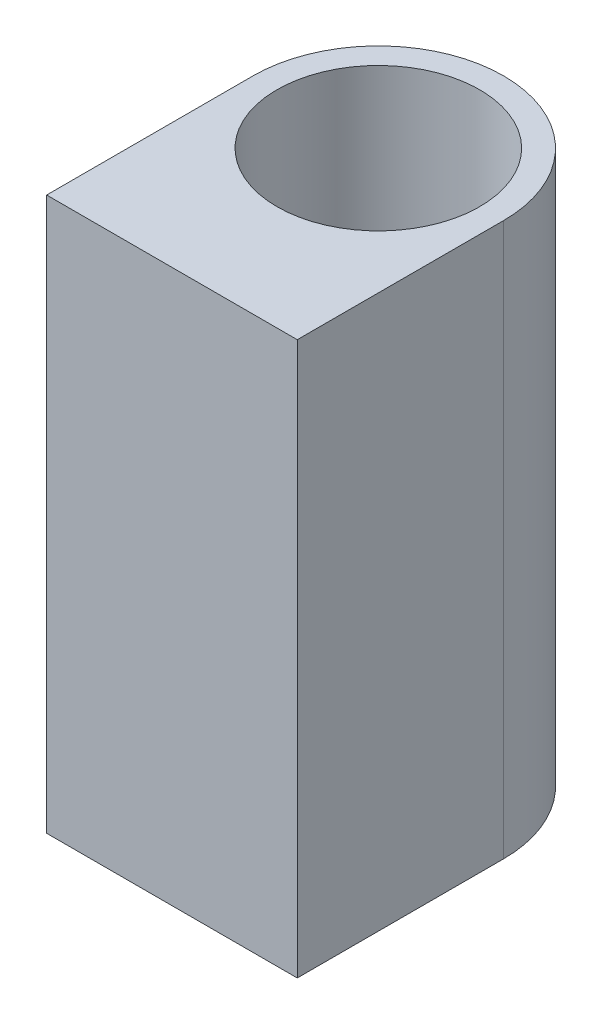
ISO-10303-21;
HEADER;
FILE_DESCRIPTION(('STEP AP214'),'2;1');
FILE_NAME('part.step','',(''),(''),'','','');
FILE_SCHEMA(('AUTOMOTIVE_DESIGN { 1 0 10303 214 1 1 1 1 }'));
ENDSEC;
DATA;
#1=APPLICATION_CONTEXT('core data for automotive mechanical design processes');
#2=APPLICATION_PROTOCOL_DEFINITION('international standard','automotive_design',2000,#1);
#3=PRODUCT_CONTEXT('',#1,'mechanical');
#4=PRODUCT('Part','Part','',(#3));
#5=PRODUCT_RELATED_PRODUCT_CATEGORY('part','',(#4));
#6=PRODUCT_DEFINITION_FORMATION('','',#4);
#7=PRODUCT_DEFINITION_CONTEXT('part definition',#1,'design');
#8=PRODUCT_DEFINITION('design','',#6,#7);
#9=PRODUCT_DEFINITION_SHAPE('','',#8);
#10=(LENGTH_UNIT() NAMED_UNIT(*) SI_UNIT(.MILLI.,.METRE.));
#11=(NAMED_UNIT(*) PLANE_ANGLE_UNIT() SI_UNIT($,.RADIAN.));
#12=(NAMED_UNIT(*) SI_UNIT($,.STERADIAN.) SOLID_ANGLE_UNIT());
#13=UNCERTAINTY_MEASURE_WITH_UNIT(LENGTH_MEASURE(1.E-05),#10,'distance_accuracy_value','');
#14=(GEOMETRIC_REPRESENTATION_CONTEXT(3) GLOBAL_UNCERTAINTY_ASSIGNED_CONTEXT((#13)) GLOBAL_UNIT_ASSIGNED_CONTEXT((#10,
#11,#12)) REPRESENTATION_CONTEXT('',''));
#15=CARTESIAN_POINT('',(0.,0.,0.));
#16=DIRECTION('',(0.,0.,1.));
#17=DIRECTION('',(1.,0.,0.));
#18=AXIS2_PLACEMENT_3D('',#15,#16,#17);
#19=CARTESIAN_POINT('',(-34.,150.,0.));
#20=DIRECTION('',(1.,0.,0.));
#21=DIRECTION('',(0.,0.,-1.));
#22=AXIS2_PLACEMENT_3D('',#19,#20,#21);
#23=PLANE('',#22);
#24=DIRECTION('',(0.,0.,1.));
#25=VECTOR('',#24,1.);
#26=CARTESIAN_POINT('',(-34.,0.,0.));
#27=LINE('',#26,#25);
#28=CARTESIAN_POINT('',(-34.,0.,-56.));
#29=VERTEX_POINT('',#28);
#30=CARTESIAN_POINT('',(-34.,0.,0.));
#31=VERTEX_POINT('',#30);
#32=EDGE_CURVE('E109',#29,#31,#27,.T.);
#33=ORIENTED_EDGE('',*,*,#32,.T.);
#34=DIRECTION('',(0.,-1.,0.));
#35=VECTOR('',#34,1.);
#36=CARTESIAN_POINT('',(-34.,150.,0.));
#37=LINE('',#36,#35);
#38=CARTESIAN_POINT('',(-34.,150.,0.));
#39=VERTEX_POINT('',#38);
#40=EDGE_CURVE('E11',#39,#31,#37,.T.);
#41=ORIENTED_EDGE('',*,*,#40,.F.);
#42=DIRECTION('',(0.,0.,1.));
#43=VECTOR('',#42,1.);
#44=CARTESIAN_POINT('',(-34.,150.,0.));
#45=LINE('',#44,#43);
#46=CARTESIAN_POINT('',(-34.,150.,-56.));
#47=VERTEX_POINT('',#46);
#48=EDGE_CURVE('E93',#47,#39,#45,.T.);
#49=ORIENTED_EDGE('',*,*,#48,.F.);
#50=DIRECTION('',(0.,-1.,0.));
#51=VECTOR('',#50,1.);
#52=CARTESIAN_POINT('',(-34.,150.,-56.));
#53=LINE('',#52,#51);
#54=EDGE_CURVE('E105',#47,#29,#53,.T.);
#55=ORIENTED_EDGE('',*,*,#54,.T.);
#56=EDGE_LOOP('',(#33,#41,#49,#55));
#57=FACE_BOUND('',#56,.T.);
#58=ADVANCED_FACE('F41',(#57),#23,.F.);
#59=CARTESIAN_POINT('',(34.,150.,0.));
#60=DIRECTION('',(0.,0.,-1.));
#61=DIRECTION('',(-1.,0.,0.));
#62=AXIS2_PLACEMENT_3D('',#59,#60,#61);
#63=PLANE('',#62);
#64=DIRECTION('',(1.,0.,0.));
#65=VECTOR('',#64,1.);
#66=CARTESIAN_POINT('',(34.,0.,0.));
#67=LINE('',#66,#65);
#68=CARTESIAN_POINT('',(34.,0.,0.));
#69=VERTEX_POINT('',#68);
#70=EDGE_CURVE('E98',#31,#69,#67,.T.);
#71=ORIENTED_EDGE('',*,*,#70,.T.);
#72=DIRECTION('',(0.,-1.,0.));
#73=VECTOR('',#72,1.);
#74=CARTESIAN_POINT('',(34.,150.,0.));
#75=LINE('',#74,#73);
#76=CARTESIAN_POINT('',(34.,150.,0.));
#77=VERTEX_POINT('',#76);
#78=EDGE_CURVE('E50',#77,#69,#75,.T.);
#79=ORIENTED_EDGE('',*,*,#78,.F.);
#80=DIRECTION('',(1.,0.,0.));
#81=VECTOR('',#80,1.);
#82=CARTESIAN_POINT('',(34.,150.,0.));
#83=LINE('',#82,#81);
#84=EDGE_CURVE('E88',#39,#77,#83,.T.);
#85=ORIENTED_EDGE('',*,*,#84,.F.);
#86=ORIENTED_EDGE('',*,*,#40,.T.);
#87=EDGE_LOOP('',(#71,#79,#85,#86));
#88=FACE_BOUND('',#87,.T.);
#89=ADVANCED_FACE('F97',(#88),#63,.F.);
#90=CARTESIAN_POINT('',(34.,150.,-56.));
#91=DIRECTION('',(-1.,0.,0.));
#92=DIRECTION('',(0.,0.,1.));
#93=AXIS2_PLACEMENT_3D('',#90,#91,#92);
#94=PLANE('',#93);
#95=DIRECTION('',(0.,0.,-1.));
#96=VECTOR('',#95,1.);
#97=CARTESIAN_POINT('',(34.,0.,-56.));
#98=LINE('',#97,#96);
#99=CARTESIAN_POINT('',(34.,0.,-56.));
#100=VERTEX_POINT('',#99);
#101=EDGE_CURVE('E75',#69,#100,#98,.T.);
#102=ORIENTED_EDGE('',*,*,#101,.T.);
#103=DIRECTION('',(0.,-1.,0.));
#104=VECTOR('',#103,1.);
#105=CARTESIAN_POINT('',(34.,150.,-56.));
#106=LINE('',#105,#104);
#107=CARTESIAN_POINT('',(34.,150.,-56.));
#108=VERTEX_POINT('',#107);
#109=EDGE_CURVE('E100',#108,#100,#106,.T.);
#110=ORIENTED_EDGE('',*,*,#109,.F.);
#111=DIRECTION('',(0.,0.,-1.));
#112=VECTOR('',#111,1.);
#113=CARTESIAN_POINT('',(34.,150.,-56.));
#114=LINE('',#113,#112);
#115=EDGE_CURVE('E91',#77,#108,#114,.T.);
#116=ORIENTED_EDGE('',*,*,#115,.F.);
#117=ORIENTED_EDGE('',*,*,#78,.T.);
#118=EDGE_LOOP('',(#102,#110,#116,#117));
#119=FACE_BOUND('',#118,.T.);
#120=ADVANCED_FACE('F101',(#119),#94,.F.);
#121=CARTESIAN_POINT('',(0.,150.,-56.));
#122=DIRECTION('',(0.,-1.,0.));
#123=DIRECTION('',(0.,0.,-1.));
#124=AXIS2_PLACEMENT_3D('',#121,#122,#123);
#125=CYLINDRICAL_SURFACE('',#124,34.);
#126=CARTESIAN_POINT('',(0.,0.,-56.));
#127=DIRECTION('',(0.,1.,0.));
#128=DIRECTION('',(0.,0.,1.));
#129=AXIS2_PLACEMENT_3D('',#126,#127,#128);
#130=CIRCLE('',#129,34.);
#131=EDGE_CURVE('E81',#100,#29,#130,.T.);
#132=ORIENTED_EDGE('',*,*,#131,.T.);
#133=ORIENTED_EDGE('',*,*,#54,.F.);
#134=CARTESIAN_POINT('',(0.,150.,-56.));
#135=DIRECTION('',(0.,1.,0.));
#136=DIRECTION('',(0.,0.,1.));
#137=AXIS2_PLACEMENT_3D('',#134,#135,#136);
#138=CIRCLE('',#137,34.);
#139=EDGE_CURVE('E58',#108,#47,#138,.T.);
#140=ORIENTED_EDGE('',*,*,#139,.F.);
#141=ORIENTED_EDGE('',*,*,#109,.T.);
#142=EDGE_LOOP('',(#132,#133,#140,#141));
#143=FACE_BOUND('',#142,.T.);
#144=ADVANCED_FACE('F123',(#143),#125,.T.);
#145=CARTESIAN_POINT('',(0.,150.,-56.));
#146=DIRECTION('',(0.,1.,0.));
#147=DIRECTION('',(0.,0.,1.));
#148=AXIS2_PLACEMENT_3D('',#145,#146,#147);
#149=PLANE('',#148);
#150=CARTESIAN_POINT('',(0.,150.,-56.));
#151=DIRECTION('',(0.,1.,0.));
#152=DIRECTION('',(0.,0.,1.));
#153=AXIS2_PLACEMENT_3D('',#150,#151,#152);
#154=CIRCLE('',#153,27.5);
#155=CARTESIAN_POINT('',(0.,150.,-28.5));
#156=VERTEX_POINT('',#155);
#157=EDGE_CURVE('E130',#156,#156,#154,.T.);
#158=ORIENTED_EDGE('',*,*,#157,.F.);
#159=EDGE_LOOP('',(#158));
#160=FACE_BOUND('',#159,.T.);
#161=ORIENTED_EDGE('',*,*,#48,.T.);
#162=ORIENTED_EDGE('',*,*,#84,.T.);
#163=ORIENTED_EDGE('',*,*,#115,.T.);
#164=ORIENTED_EDGE('',*,*,#139,.T.);
#165=EDGE_LOOP('',(#161,#162,#163,#164));
#166=FACE_BOUND('',#165,.T.);
#167=ADVANCED_FACE('F89',(#160,#166),#149,.T.);
#168=CARTESIAN_POINT('',(0.,0.,-56.));
#169=DIRECTION('',(0.,1.,0.));
#170=DIRECTION('',(0.,0.,1.));
#171=AXIS2_PLACEMENT_3D('',#168,#169,#170);
#172=PLANE('',#171);
#173=CARTESIAN_POINT('',(0.,0.,-56.));
#174=DIRECTION('',(0.,-1.,0.));
#175=DIRECTION('',(0.,0.,-1.));
#176=AXIS2_PLACEMENT_3D('',#173,#174,#175);
#177=CIRCLE('',#176,27.5);
#178=CARTESIAN_POINT('',(0.,0.,-83.5));
#179=VERTEX_POINT('',#178);
#180=EDGE_CURVE('E138',#179,#179,#177,.T.);
#181=ORIENTED_EDGE('',*,*,#180,.F.);
#182=EDGE_LOOP('',(#181));
#183=FACE_BOUND('',#182,.T.);
#184=ORIENTED_EDGE('',*,*,#32,.F.);
#185=ORIENTED_EDGE('',*,*,#131,.F.);
#186=ORIENTED_EDGE('',*,*,#101,.F.);
#187=ORIENTED_EDGE('',*,*,#70,.F.);
#188=EDGE_LOOP('',(#184,#185,#186,#187));
#189=FACE_BOUND('',#188,.T.);
#190=ADVANCED_FACE('F126',(#183,#189),#172,.F.);
#191=CARTESIAN_POINT('',(0.,80.,-56.));
#192=DIRECTION('',(0.,1.,0.));
#193=DIRECTION('',(0.,0.,1.));
#194=AXIS2_PLACEMENT_3D('',#191,#192,#193);
#195=CYLINDRICAL_SURFACE('',#194,27.5);
#196=CARTESIAN_POINT('',(0.,80.,-56.));
#197=DIRECTION('',(0.,1.,0.));
#198=DIRECTION('',(0.,0.,1.));
#199=AXIS2_PLACEMENT_3D('',#196,#197,#198);
#200=CIRCLE('',#199,27.5);
#201=CARTESIAN_POINT('',(0.,80.,-28.5));
#202=VERTEX_POINT('',#201);
#203=EDGE_CURVE('E113',#202,#202,#200,.T.);
#204=ORIENTED_EDGE('',*,*,#203,.F.);
#205=EDGE_LOOP('',(#204));
#206=FACE_BOUND('',#205,.T.);
#207=ORIENTED_EDGE('',*,*,#157,.T.);
#208=EDGE_LOOP('',(#207));
#209=FACE_BOUND('',#208,.T.);
#210=ADVANCED_FACE('F156',(#206,#209),#195,.F.);
#211=CARTESIAN_POINT('',(0.,80.,-56.));
#212=DIRECTION('',(0.,1.,0.));
#213=DIRECTION('',(0.,0.,1.));
#214=AXIS2_PLACEMENT_3D('',#211,#212,#213);
#215=PLANE('',#214);
#216=ORIENTED_EDGE('',*,*,#203,.T.);
#217=EDGE_LOOP('',(#216));
#218=FACE_BOUND('',#217,.T.);
#219=ADVANCED_FACE('F151',(#218),#215,.T.);
#220=CARTESIAN_POINT('',(0.,70.,-56.));
#221=DIRECTION('',(0.,-1.,0.));
#222=DIRECTION('',(0.,0.,-1.));
#223=AXIS2_PLACEMENT_3D('',#220,#221,#222);
#224=CYLINDRICAL_SURFACE('',#223,27.5);
#225=CARTESIAN_POINT('',(0.,70.,-56.));
#226=DIRECTION('',(0.,-1.,0.));
#227=DIRECTION('',(0.,0.,-1.));
#228=AXIS2_PLACEMENT_3D('',#225,#226,#227);
#229=CIRCLE('',#228,27.5);
#230=CARTESIAN_POINT('',(0.,70.,-83.5));
#231=VERTEX_POINT('',#230);
#232=EDGE_CURVE('E134',#231,#231,#229,.T.);
#233=ORIENTED_EDGE('',*,*,#232,.F.);
#234=EDGE_LOOP('',(#233));
#235=FACE_BOUND('',#234,.T.);
#236=ORIENTED_EDGE('',*,*,#180,.T.);
#237=EDGE_LOOP('',(#236));
#238=FACE_BOUND('',#237,.T.);
#239=ADVANCED_FACE('F148',(#235,#238),#224,.F.);
#240=CARTESIAN_POINT('',(0.,70.,-56.));
#241=DIRECTION('',(0.,-1.,0.));
#242=DIRECTION('',(0.,0.,-1.));
#243=AXIS2_PLACEMENT_3D('',#240,#241,#242);
#244=PLANE('',#243);
#245=ORIENTED_EDGE('',*,*,#232,.T.);
#246=EDGE_LOOP('',(#245));
#247=FACE_BOUND('',#246,.T.);
#248=ADVANCED_FACE('F146',(#247),#244,.T.);
#249=CLOSED_SHELL('',(#58,#89,#120,#144,#167,#190,#210,#219,#239,#248));
#250=MANIFOLD_SOLID_BREP('B2',#249);
#251=ADVANCED_BREP_SHAPE_REPRESENTATION('',(#18,#250),#14);
#252=SHAPE_DEFINITION_REPRESENTATION(#9,#251);
ENDSEC;
END-ISO-10303-21;
